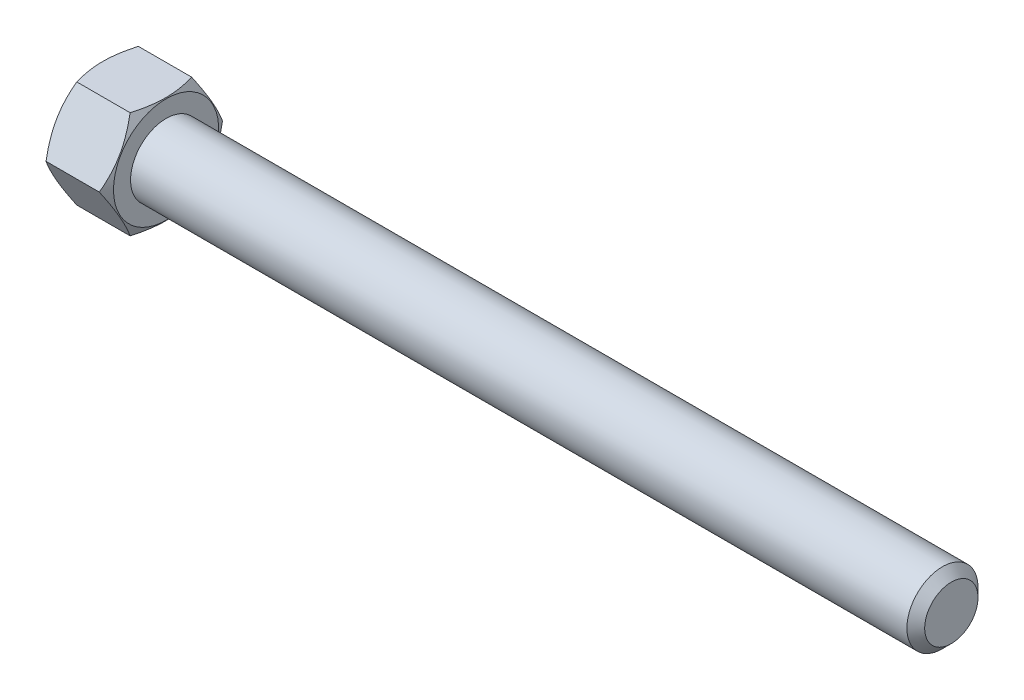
from build123d import *

# Parameters (mm, degrees)
ESQUISSE1_W             = 286.5
ESQUISSE1_H             = 12
CHANFREIN1_SIZE         = 3
EXTRUSION2_DEPTH        = 21.5
ESQUISSE12_R            = 10.5
ENL_V_MAT_EXTRU_1_DEPTH = 288.816347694


with BuildPart() as part:
    # Esquisse1 → R_volution1 (revolve)
    with BuildSketch(Plane.XY, mode=Mode.PRIVATE) as r_volution1_sk:
        with Locations((143.25, 6)):
            Rectangle(ESQUISSE1_W, ESQUISSE1_H)
    revolve(r_volution1_sk.sketch.rotate(Axis((0, 0, 0), (1, 0, 0)), 90), axis=Axis((0, 0, 0), (1, 0, 0)))

    # Chanfrein1
    chanfrein1_edges = [part.edges().sort_by_distance(p)[0] for p in [
        (286.5, 0, -12),
    ]]
    chamfer(chanfrein1_edges, length=CHANFREIN1_SIZE)


with BuildPart() as body_2:
    # Esquisse5 → Extrusion2 (new body)
    with BuildSketch(Plane.ZY):
        Polygon((20.784609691, 0), (10.392304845, 18), (-10.392304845, 18), (-20.784609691, 0), (-10.392304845, -18), (10.392304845, -18), align=None)
    extrude(amount=-EXTRUSION2_DEPTH)

    # Esquisse7 → Enl_vement de mati_re-R_volution3 (revolve, cut)
    with BuildSketch(Plane(origin=(0, 0, 0), x_dir=(1, 0, 0), z_dir=(0, 1, 0)), mode=Mode.PRIVATE) as enl_vement_de_mati_re_r_volution3_sk:
        Polygon((1.75, 20.784609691), (0, 17.753520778), (0, 20.784609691), align=None)
        Polygon((21.5, 17.753520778), (19.75, 20.784609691), (21.5, 20.784609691), align=None)
    revolve(enl_vement_de_mati_re_r_volution3_sk.sketch.rotate(Axis((0, 0, 0), (1, 0, 0)), 180.000000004), axis=Axis((0, 0, 0), (1, 0, 0)), mode=Mode.SUBTRACT)

    # Esquisse12 → Enl_v. mat.-Extru.1 (cut, through all)
    with BuildSketch(Plane.ZY):
        Circle(ESQUISSE12_R)
    extrude(amount=-ENL_V_MAT_EXTRU_1_DEPTH, mode=Mode.SUBTRACT)


solid = Compound([part.part, body_2.part])
